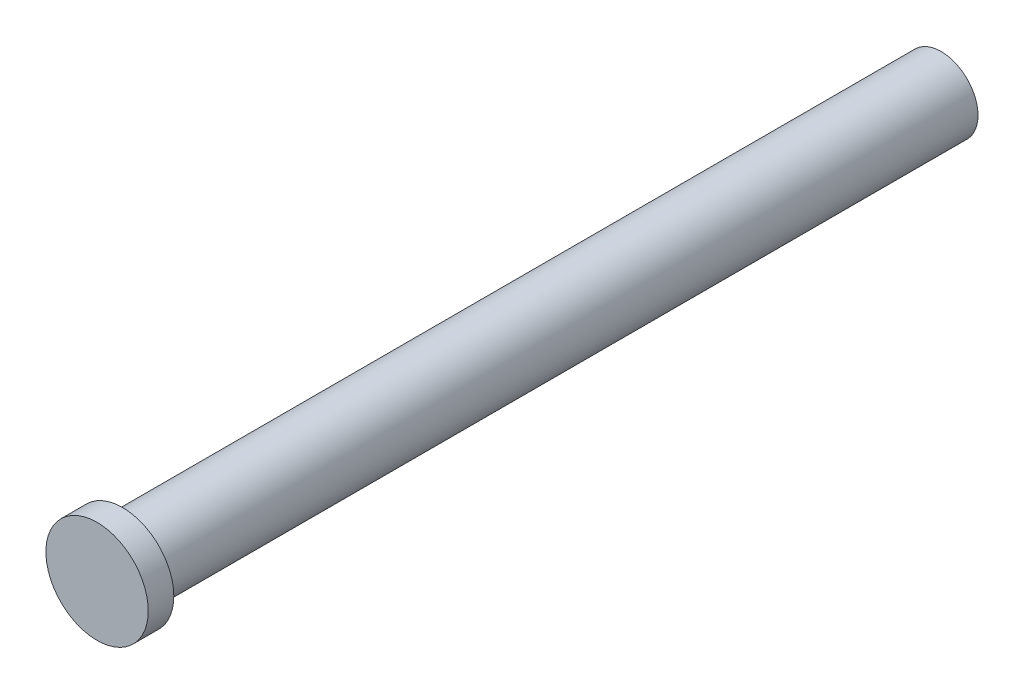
ISO-10303-21;
HEADER;
FILE_DESCRIPTION(('STEP AP214'),'2;1');
FILE_NAME('part.step','',(''),(''),'','','');
FILE_SCHEMA(('AUTOMOTIVE_DESIGN { 1 0 10303 214 1 1 1 1 }'));
ENDSEC;
DATA;
#1=APPLICATION_CONTEXT('core data for automotive mechanical design processes');
#2=APPLICATION_PROTOCOL_DEFINITION('international standard','automotive_design',2000,#1);
#3=PRODUCT_CONTEXT('',#1,'mechanical');
#4=PRODUCT('Part','Part','',(#3));
#5=PRODUCT_RELATED_PRODUCT_CATEGORY('part','',(#4));
#6=PRODUCT_DEFINITION_FORMATION('','',#4);
#7=PRODUCT_DEFINITION_CONTEXT('part definition',#1,'design');
#8=PRODUCT_DEFINITION('design','',#6,#7);
#9=PRODUCT_DEFINITION_SHAPE('','',#8);
#10=(LENGTH_UNIT() NAMED_UNIT(*) SI_UNIT(.MILLI.,.METRE.));
#11=(NAMED_UNIT(*) PLANE_ANGLE_UNIT() SI_UNIT($,.RADIAN.));
#12=(NAMED_UNIT(*) SI_UNIT($,.STERADIAN.) SOLID_ANGLE_UNIT());
#13=UNCERTAINTY_MEASURE_WITH_UNIT(LENGTH_MEASURE(1.E-05),#10,'distance_accuracy_value','');
#14=(GEOMETRIC_REPRESENTATION_CONTEXT(3) GLOBAL_UNCERTAINTY_ASSIGNED_CONTEXT((#13)) GLOBAL_UNIT_ASSIGNED_CONTEXT((#10,
#11,#12)) REPRESENTATION_CONTEXT('',''));
#15=CARTESIAN_POINT('',(0.,0.,0.));
#16=DIRECTION('',(0.,0.,1.));
#17=DIRECTION('',(1.,0.,0.));
#18=AXIS2_PLACEMENT_3D('',#15,#16,#17);
#19=CARTESIAN_POINT('',(0.,0.,101.6));
#20=DIRECTION('',(0.,0.,-1.));
#21=DIRECTION('',(-1.,0.,0.));
#22=AXIS2_PLACEMENT_3D('',#19,#20,#21);
#23=CYLINDRICAL_SURFACE('',#22,4.572);
#24=CARTESIAN_POINT('',(0.,0.,101.6));
#25=DIRECTION('',(0.,0.,1.));
#26=DIRECTION('',(1.,0.,0.));
#27=AXIS2_PLACEMENT_3D('',#24,#25,#26);
#28=CIRCLE('',#27,4.572);
#29=CARTESIAN_POINT('',(4.572,0.,101.6));
#30=VERTEX_POINT('',#29);
#31=EDGE_CURVE('E10',#30,#30,#28,.T.);
#32=ORIENTED_EDGE('',*,*,#31,.F.);
#33=EDGE_LOOP('',(#32));
#34=FACE_BOUND('',#33,.T.);
#35=CARTESIAN_POINT('',(0.,0.,0.));
#36=DIRECTION('',(0.,0.,1.));
#37=DIRECTION('',(1.,0.,0.));
#38=AXIS2_PLACEMENT_3D('',#35,#36,#37);
#39=CIRCLE('',#38,4.572);
#40=CARTESIAN_POINT('',(4.572,0.,0.));
#41=VERTEX_POINT('',#40);
#42=EDGE_CURVE('E40',#41,#41,#39,.T.);
#43=ORIENTED_EDGE('',*,*,#42,.T.);
#44=EDGE_LOOP('',(#43));
#45=FACE_BOUND('',#44,.T.);
#46=ADVANCED_FACE('F37',(#34,#45),#23,.T.);
#47=CARTESIAN_POINT('',(0.,0.,0.));
#48=DIRECTION('',(0.,0.,1.));
#49=DIRECTION('',(1.,0.,0.));
#50=AXIS2_PLACEMENT_3D('',#47,#48,#49);
#51=PLANE('',#50);
#52=ORIENTED_EDGE('',*,*,#42,.F.);
#53=EDGE_LOOP('',(#52));
#54=FACE_BOUND('',#53,.T.);
#55=ADVANCED_FACE('F64',(#54),#51,.F.);
#56=CARTESIAN_POINT('',(0.,0.,104.775));
#57=DIRECTION('',(0.,0.,-1.));
#58=DIRECTION('',(-1.,0.,0.));
#59=AXIS2_PLACEMENT_3D('',#56,#57,#58);
#60=CYLINDRICAL_SURFACE('',#59,6.35);
#61=CARTESIAN_POINT('',(0.,0.,104.775));
#62=DIRECTION('',(0.,0.,1.));
#63=DIRECTION('',(1.,0.,0.));
#64=AXIS2_PLACEMENT_3D('',#61,#62,#63);
#65=CIRCLE('',#64,6.35);
#66=CARTESIAN_POINT('',(6.35,0.,104.775));
#67=VERTEX_POINT('',#66);
#68=EDGE_CURVE('E49',#67,#67,#65,.T.);
#69=ORIENTED_EDGE('',*,*,#68,.F.);
#70=EDGE_LOOP('',(#69));
#71=FACE_BOUND('',#70,.T.);
#72=CARTESIAN_POINT('',(0.,0.,101.6));
#73=DIRECTION('',(0.,0.,1.));
#74=DIRECTION('',(1.,0.,0.));
#75=AXIS2_PLACEMENT_3D('',#72,#73,#74);
#76=CIRCLE('',#75,6.35);
#77=CARTESIAN_POINT('',(6.35,0.,101.6));
#78=VERTEX_POINT('',#77);
#79=EDGE_CURVE('E51',#78,#78,#76,.T.);
#80=ORIENTED_EDGE('',*,*,#79,.T.);
#81=EDGE_LOOP('',(#80));
#82=FACE_BOUND('',#81,.T.);
#83=ADVANCED_FACE('F61',(#71,#82),#60,.T.);
#84=CARTESIAN_POINT('',(0.,0.,104.775));
#85=DIRECTION('',(0.,0.,1.));
#86=DIRECTION('',(1.,0.,0.));
#87=AXIS2_PLACEMENT_3D('',#84,#85,#86);
#88=PLANE('',#87);
#89=ORIENTED_EDGE('',*,*,#68,.T.);
#90=EDGE_LOOP('',(#89));
#91=FACE_BOUND('',#90,.T.);
#92=ADVANCED_FACE('F59',(#91),#88,.T.);
#93=CARTESIAN_POINT('',(0.,0.,101.6));
#94=DIRECTION('',(0.,0.,1.));
#95=DIRECTION('',(1.,0.,0.));
#96=AXIS2_PLACEMENT_3D('',#93,#94,#95);
#97=PLANE('',#96);
#98=ORIENTED_EDGE('',*,*,#31,.T.);
#99=EDGE_LOOP('',(#98));
#100=FACE_BOUND('',#99,.T.);
#101=ORIENTED_EDGE('',*,*,#79,.F.);
#102=EDGE_LOOP('',(#101));
#103=FACE_BOUND('',#102,.T.);
#104=ADVANCED_FACE('F68',(#100,#103),#97,.F.);
#105=CLOSED_SHELL('',(#46,#55,#83,#92,#104));
#106=MANIFOLD_SOLID_BREP('B2',#105);
#107=ADVANCED_BREP_SHAPE_REPRESENTATION('',(#18,#106),#14);
#108=SHAPE_DEFINITION_REPRESENTATION(#9,#107);
ENDSEC;
END-ISO-10303-21;
